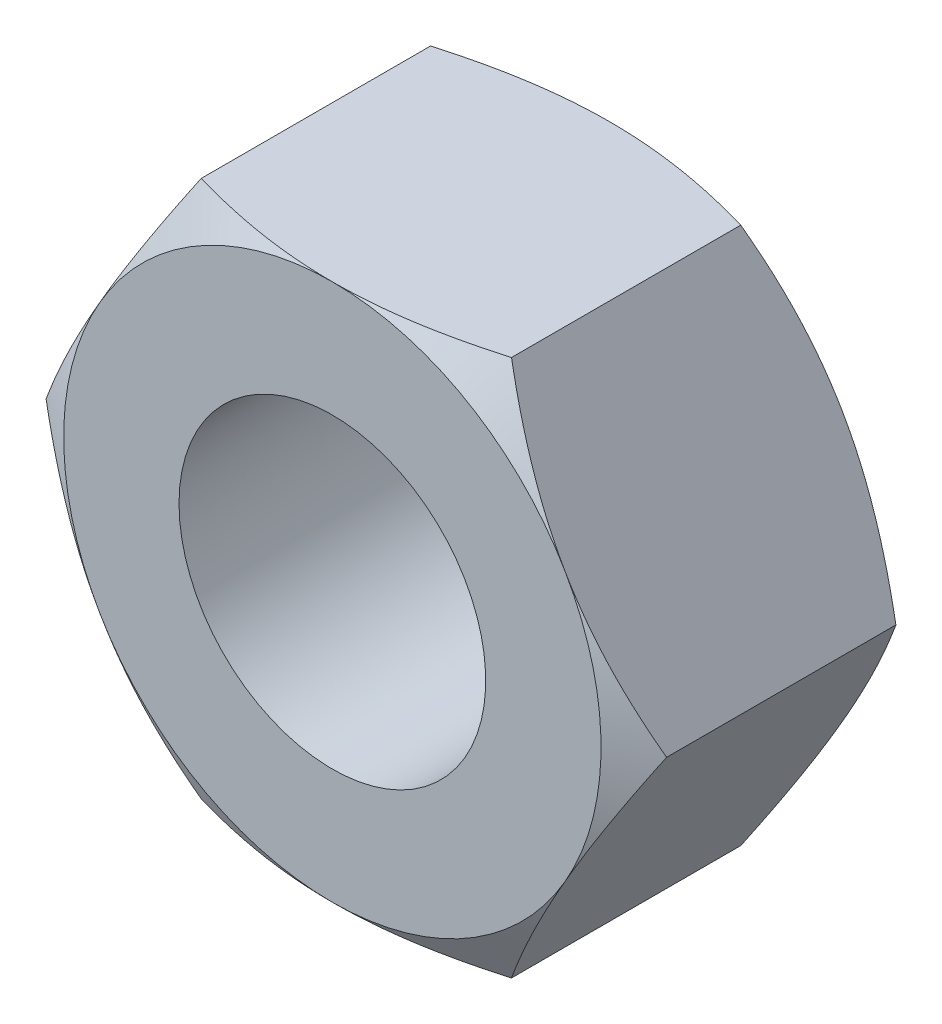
from build123d import *

# Parameters (mm, degrees)
BOSS_EXTRUDE1_DEPTH = 5.7404
SKETCH3_OUTSIDE_W   = 38.318
SKETCH3_OUTSIDE_H   = 36.598
SKETCH3_OUTSIDE_R   = 5.5626
CUT_EXTRUDE1_DEPTH  = 5.7404
CUT_EXTRUDE1_DRAFT  = -60
SKETCH4_OUTSIDE_W   = 38.318
SKETCH4_OUTSIDE_H   = 36.598
SKETCH4_OUTSIDE_R   = 5.5626
CUT_EXTRUDE2_DEPTH  = 5.7404
CUT_EXTRUDE2_DRAFT  = -60
SKETCH5_R           = 3.175
CUT_EXTRUDE3_DEPTH  = 5.7404


with BuildPart() as part:
    # Sketch2 → Boss-Extrude1 (new body)
    with BuildSketch(Plane.XY):
        Polygon((-6.423137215, 0), (-3.211568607, -5.5626), (3.211568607, -5.5626), (6.423137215, 0), (3.211568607, 5.5626), (-3.211568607, 5.5626), align=None)
    extrude(amount=BOSS_EXTRUDE1_DEPTH)


with BuildPart() as cut_extrude1_tool:
    # Sketch3 outside → Cut-Extrude1 (with draft: the straight prism first)
    with BuildSketch(Plane(origin=(0, 0, 0), x_dir=(-1, 0, 0), z_dir=(0, 0, -1))):
        Rectangle(SKETCH3_OUTSIDE_W, SKETCH3_OUTSIDE_H)
        Circle(SKETCH3_OUTSIDE_R, mode=Mode.SUBTRACT)
    extrude(amount=-CUT_EXTRUDE1_DEPTH)
    # Cut-Extrude1: the draft: its side faces are tilted about the plane it starts from
    cut_extrude1_sides = [cut_extrude1_tool.faces().sort_by_distance(p)[0] for p in [
        (0, -18.299, 2.8702),
        (-19.159, 0, 2.8702),
        (0, 18.299, 2.8702),
        (19.159, 0, 2.8702),
        (5.5626, 0, 2.8702),
    ]]
    draft(cut_extrude1_sides, Plane(origin=(0, 0, 0), x_dir=(-1, 0, 0), z_dir=(0, 0, -1)), CUT_EXTRUDE1_DRAFT)


with BuildPart() as part_1:
    add(part.part)

    # Cut-Extrude1: cut by cut_extrude1_tool
    add(cut_extrude1_tool.part, mode=Mode.SUBTRACT)


with BuildPart() as cut_extrude2_tool:
    # Sketch4 outside → Cut-Extrude2 (with draft: the straight prism first)
    with BuildSketch(Plane.XY.offset(5.7404)):
        Rectangle(SKETCH4_OUTSIDE_W, SKETCH4_OUTSIDE_H)
        Circle(SKETCH4_OUTSIDE_R, mode=Mode.SUBTRACT)
    extrude(amount=-CUT_EXTRUDE2_DEPTH)
    # Cut-Extrude2: the draft: its side faces are tilted about the plane it starts from
    cut_extrude2_sides = [cut_extrude2_tool.faces().sort_by_distance(p)[0] for p in [
        (0, -18.299, 2.8702),
        (19.159, 0, 2.8702),
        (0, 18.299, 2.8702),
        (-19.159, 0, 2.8702),
        (-5.5626, 0, 2.8702),
    ]]
    draft(cut_extrude2_sides, Plane.XY.offset(5.7404), CUT_EXTRUDE2_DRAFT)


with BuildPart() as part_2:
    add(part_1.part)

    # Cut-Extrude2: cut by cut_extrude2_tool
    add(cut_extrude2_tool.part, mode=Mode.SUBTRACT)

    # Sketch5 → Cut-Extrude3 (cut)
    with BuildSketch(Plane(origin=(0, 0, 0), x_dir=(-1, 0, 0), z_dir=(0, 0, -1))):
        Circle(SKETCH5_R)
    extrude(amount=-CUT_EXTRUDE3_DEPTH, mode=Mode.SUBTRACT)


solid = part_2.part
